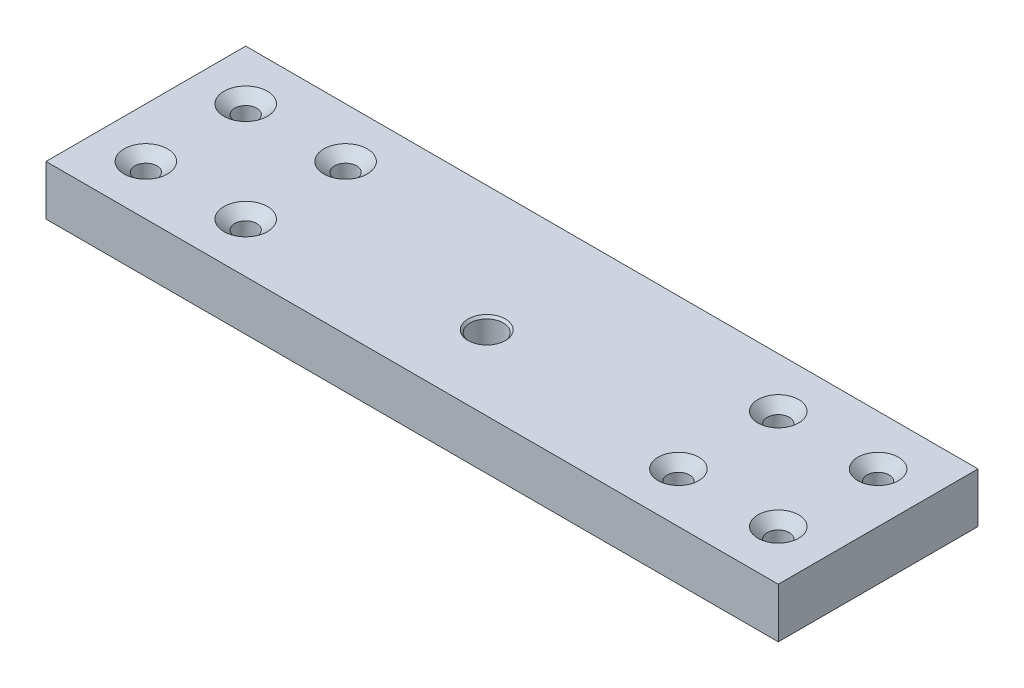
from build123d import *
from OCP.BRepFilletAPI import BRepFilletAPI_MakeChamfer

# Parameters (mm, degrees)
SKETCH1_W                       = 139.7
SKETCH1_H                       = 76.2
SKETCH1_R                       = 4.2164
EXTRUDE1_DEPTH                  = 19.05
SKETCH2_R                       = 6.35
EXTRUDE2_DEPTH                  = 147.05
CHAMFER_FOR_91253A313_SIZE      = 4.0894
CHAMFER_FOR_91253A313_SIZE2     = 3.554861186
SKETCH3_W                       = 50.8
SKETCH3_H                       = 25.4
SKETCH3_R                       = 2.3876
EXTRUDE3_DEPTH                  = 19.05
F_6_32_TAPPED_HOLE1_D           = 2.7051
F_6_32_TAPPED_HOLE1_DEPTH       = 11.176
F_6_32_TAPPED_HOLE1_CSINK_D     = 4.7752
F_6_32_TAPPED_HOLE1_CSINK_ANGLE = 90
F_6_32_TAPPED_HOLE1_TIP         = 0.81269403
CHAMFER1_SIZE                   = 0.79375
CHAMFER1_SIZE2                  = 0.913104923
SKETCH7_W                       = 279.4
SKETCH7_H                       = 40.288391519
EXTRUDE4_DEPTH                  = 155.632604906


with BuildPart() as part:
    # Sketch1 → Extrude1 (new body)
    with BuildSketch(Plane(origin=(0, 0, 0), x_dir=(1, 0, 0), z_dir=(0, 1, 0))):
        with Locations((-69.85, 0)):
            Rectangle(SKETCH1_W, SKETCH1_H)
        with Locations(Location((-120.65, 19.05, 0), (0, 0, 90))):
            Circle(SKETCH1_R, mode=Mode.SUBTRACT)
        with Locations(Location((-82.55, 19.05, 0), (0, 0, 90))):
            Circle(SKETCH1_R, mode=Mode.SUBTRACT)
        with Locations(Location((-82.55, -19.05, 0), (0, 0, 90))):
            Circle(SKETCH1_R, mode=Mode.SUBTRACT)
        with Locations(Location((-120.65, -19.05, 0), (0, 0, 90))):
            Circle(SKETCH1_R, mode=Mode.SUBTRACT)
    extrude(amount=EXTRUDE1_DEPTH)

    # Mirror1: part across plane


with BuildPart() as part_1:
    add(part.part)
    add(part.part.mirror(Plane(origin=(0, 19.05, -38.1), x_dir=(0, 0, 1), z_dir=(-1, 0, 0))))

    # Sketch2 → Extrude2 (cut, through all)
    with BuildSketch(Plane(origin=(0, 19.05, 0), x_dir=(-1, 0, 0), z_dir=(0, 1, 0))):
        with Locations(Location((0, 9.64184, 0), (0, 0, 90))):
            Circle(SKETCH2_R)
    extrude(amount=-EXTRUDE2_DEPTH, mode=Mode.SUBTRACT)

    # Chamfer for 91253A313: one chamfer whose edges measure the first distance from different faces: ONE call of the kernel's chamfer builder (chamfer() names one face for all edges)
    chamfer_for_91253a313_edges_1 = [part_1.edges().sort_by_distance(p)[0] for p in [
        (-120.65, 19.05, -14.8336),
        (-82.55, 19.05, -14.8336),
        (-82.55, 19.05, 23.2664),
        (-120.65, 19.05, 23.2664),
    ]]
    chamfer_for_91253a313_side_1 = [part_1.faces().sort_by_distance(p)[0] for p in [
        (0, 19.05, -0.058956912),
    ]]
    chamfer_for_91253a313_edges_2 = [part_1.edges().sort_by_distance(p)[0] for p in [
        (82.55, 19.05, 23.2664),
    ]]
    chamfer_for_91253a313_side_2 = [part_1.faces().sort_by_distance(p)[0] for p in [
        (82.55, 9.525, 23.2664),
    ]]
    chamfer_for_91253a313_edges_3 = [part_1.edges().sort_by_distance(p)[0] for p in [
        (120.65, 19.05, -14.8336),
    ]]
    chamfer_for_91253a313_side_3 = [part_1.faces().sort_by_distance(p)[0] for p in [
        (120.65, 9.525, -14.8336),
    ]]
    chamfer_for_91253a313_edges_4 = [part_1.edges().sort_by_distance(p)[0] for p in [
        (82.55, 19.05, -14.8336),
    ]]
    chamfer_for_91253a313_side_4 = [part_1.faces().sort_by_distance(p)[0] for p in [
        (82.55, 9.525, -14.8336),
    ]]
    chamfer_for_91253a313_edges_5 = [part_1.edges().sort_by_distance(p)[0] for p in [
        (120.65, 19.05, 23.2664),
    ]]
    chamfer_for_91253a313_side_5 = [part_1.faces().sort_by_distance(p)[0] for p in [
        (120.65, 9.525, 23.2664),
    ]]
    chamfer_for_91253a313 = BRepFilletAPI_MakeChamfer(part_1.part.solid().wrapped)
    for e in chamfer_for_91253a313_edges_1:
        chamfer_for_91253a313.Add(CHAMFER_FOR_91253A313_SIZE, CHAMFER_FOR_91253A313_SIZE2, e.wrapped, chamfer_for_91253a313_side_1[0].wrapped)  # the first distance lies on this face
    for e in chamfer_for_91253a313_edges_2:
        chamfer_for_91253a313.Add(CHAMFER_FOR_91253A313_SIZE, CHAMFER_FOR_91253A313_SIZE2, e.wrapped, chamfer_for_91253a313_side_2[0].wrapped)  # the first distance lies on this face
    for e in chamfer_for_91253a313_edges_3:
        chamfer_for_91253a313.Add(CHAMFER_FOR_91253A313_SIZE, CHAMFER_FOR_91253A313_SIZE2, e.wrapped, chamfer_for_91253a313_side_3[0].wrapped)  # the first distance lies on this face
    for e in chamfer_for_91253a313_edges_4:
        chamfer_for_91253a313.Add(CHAMFER_FOR_91253A313_SIZE, CHAMFER_FOR_91253A313_SIZE2, e.wrapped, chamfer_for_91253a313_side_4[0].wrapped)  # the first distance lies on this face
    for e in chamfer_for_91253a313_edges_5:
        chamfer_for_91253a313.Add(CHAMFER_FOR_91253A313_SIZE, CHAMFER_FOR_91253A313_SIZE2, e.wrapped, chamfer_for_91253a313_side_5[0].wrapped)  # the first distance lies on this face
    add(Compound.cast(chamfer_for_91253a313.Shape()), mode=Mode.REPLACE)

    # Sketch3 → Extrude3 (add)
    with BuildSketch(Plane.XZ):
        with Locations((0, 50.8)):
            Rectangle(SKETCH3_W, SKETCH3_H)
        with Locations(Location((0, 57.15, 0), (0, 0, 270))):
            Circle(SKETCH3_R, mode=Mode.SUBTRACT)
    extrude(amount=-EXTRUDE3_DEPTH)

    # 6-32 Tapped Hole1
    with Locations(Plane(origin=(0, 9.525, 63.5), x_dir=(1, 0, 0), z_dir=(0, 0, 1))):
        with Locations((0, 0)):
            CounterSinkHole(F_6_32_TAPPED_HOLE1_D / 2, F_6_32_TAPPED_HOLE1_CSINK_D / 2, depth=F_6_32_TAPPED_HOLE1_DEPTH, counter_sink_angle=F_6_32_TAPPED_HOLE1_CSINK_ANGLE)
            with Locations((0, 0, -(F_6_32_TAPPED_HOLE1_DEPTH + F_6_32_TAPPED_HOLE1_TIP / 2))):  # 118° drill point
                Cone(0, F_6_32_TAPPED_HOLE1_D / 2, F_6_32_TAPPED_HOLE1_TIP, mode=Mode.SUBTRACT)

    # Chamfer1: one chamfer whose edges measure the first distance from different faces: ONE call of the kernel's chamfer builder (chamfer() names one face for all edges)
    chamfer1_edges_1 = [part_1.edges().sort_by_distance(p)[0] for p in [
        (-120.65, 0, -14.8336),
    ]]
    chamfer1_side_1 = [part_1.faces().sort_by_distance(p)[0] for p in [
        (-120.65, 7.747569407, -14.8336),
    ]]
    chamfer1_edges_2 = [part_1.edges().sort_by_distance(p)[0] for p in [
        (-82.55, 0, -14.8336),
    ]]
    chamfer1_side_2 = [part_1.faces().sort_by_distance(p)[0] for p in [
        (-82.55, 7.747569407, -14.8336),
    ]]
    chamfer1_edges_3 = [part_1.edges().sort_by_distance(p)[0] for p in [
        (-82.55, 0, 23.2664),
    ]]
    chamfer1_side_3 = [part_1.faces().sort_by_distance(p)[0] for p in [
        (-82.55, 7.747569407, 23.2664),
    ]]
    chamfer1_edges_4 = [part_1.edges().sort_by_distance(p)[0] for p in [
        (-120.65, 0, 23.2664),
    ]]
    chamfer1_side_4 = [part_1.faces().sort_by_distance(p)[0] for p in [
        (-120.65, 7.747569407, 23.2664),
    ]]
    chamfer1_edges_5 = [part_1.edges().sort_by_distance(p)[0] for p in [
        (120.65, 0, -14.8336),
        (82.55, 0, -14.8336),
        (82.55, 0, 23.2664),
        (120.65, 0, 23.2664),
        (0, 0, 59.5376),
    ]]
    chamfer1_side_5 = [part_1.faces().sort_by_distance(p)[0] for p in [
        (0, 0, 2.878838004),
    ]]
    chamfer1_edges_6 = [part_1.edges().sort_by_distance(p)[0] for p in [
        (0, 0, 3.29184),
    ]]
    chamfer1_side_6 = [part_1.faces().sort_by_distance(p)[0] for p in [
        (0, 9.525, 3.29184),
    ]]
    chamfer1_edges_7 = [part_1.edges().sort_by_distance(p)[0] for p in [
        (0, 19.05, 3.29184),
        (0, 19.05, 59.5376),
    ]]
    chamfer1_side_7 = [part_1.faces().sort_by_distance(p)[0] for p in [
        (0.527246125, 19.05, 3.041939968),
    ]]
    chamfer1 = BRepFilletAPI_MakeChamfer(part_1.part.solid().wrapped)
    for e in chamfer1_edges_1:
        chamfer1.Add(CHAMFER1_SIZE, CHAMFER1_SIZE2, e.wrapped, chamfer1_side_1[0].wrapped)  # the first distance lies on this face
    for e in chamfer1_edges_2:
        chamfer1.Add(CHAMFER1_SIZE, CHAMFER1_SIZE2, e.wrapped, chamfer1_side_2[0].wrapped)  # the first distance lies on this face
    for e in chamfer1_edges_3:
        chamfer1.Add(CHAMFER1_SIZE, CHAMFER1_SIZE2, e.wrapped, chamfer1_side_3[0].wrapped)  # the first distance lies on this face
    for e in chamfer1_edges_4:
        chamfer1.Add(CHAMFER1_SIZE, CHAMFER1_SIZE2, e.wrapped, chamfer1_side_4[0].wrapped)  # the first distance lies on this face
    for e in chamfer1_edges_5:
        chamfer1.Add(CHAMFER1_SIZE, CHAMFER1_SIZE2, e.wrapped, chamfer1_side_5[0].wrapped)  # the first distance lies on this face
    for e in chamfer1_edges_6:
        chamfer1.Add(CHAMFER1_SIZE, CHAMFER1_SIZE2, e.wrapped, chamfer1_side_6[0].wrapped)  # the first distance lies on this face
    for e in chamfer1_edges_7:
        chamfer1.Add(CHAMFER1_SIZE, CHAMFER1_SIZE2, e.wrapped, chamfer1_side_7[0].wrapped)  # the first distance lies on this face
    add(Compound.cast(chamfer1.Shape()), mode=Mode.REPLACE)

    # Sketch7 → Extrude4 (cut, through all)
    with BuildSketch(Plane(origin=(0, 19.05, 0), x_dir=(1, 0, 0), z_dir=(0, 1, 0))):
        with Locations((0, -58.24419576)):
            Rectangle(SKETCH7_W, SKETCH7_H)
    extrude(amount=-EXTRUDE4_DEPTH, mode=Mode.SUBTRACT)


solid = part_1.part
